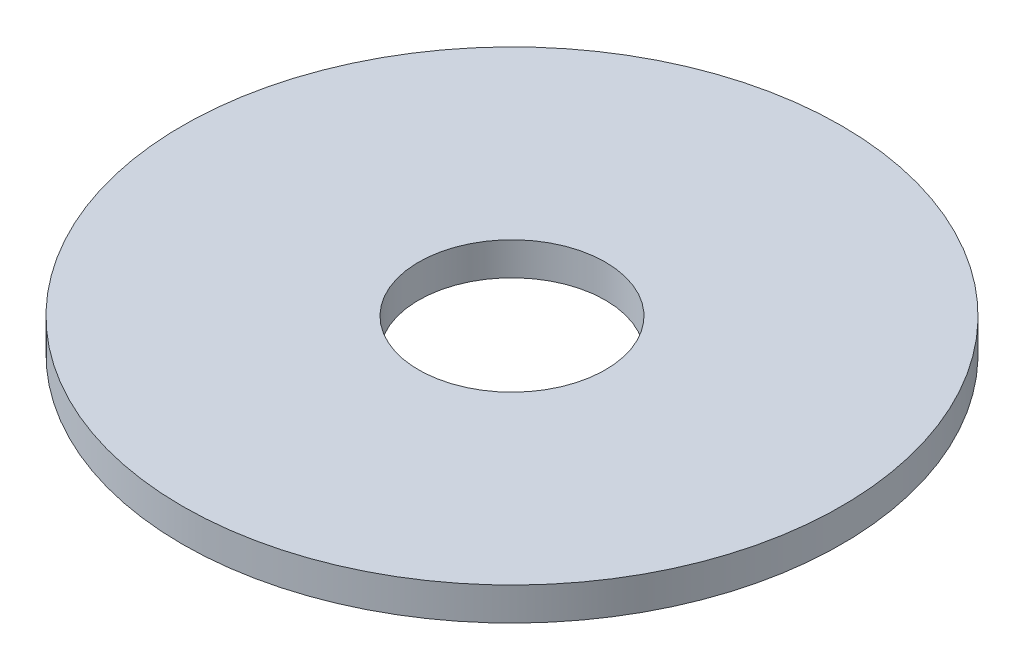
ISO-10303-21;
HEADER;
FILE_DESCRIPTION(('STEP AP214'),'2;1');
FILE_NAME('part.step','',(''),(''),'','','');
FILE_SCHEMA(('AUTOMOTIVE_DESIGN { 1 0 10303 214 1 1 1 1 }'));
ENDSEC;
DATA;
#1=APPLICATION_CONTEXT('core data for automotive mechanical design processes');
#2=APPLICATION_PROTOCOL_DEFINITION('international standard','automotive_design',2000,#1);
#3=PRODUCT_CONTEXT('',#1,'mechanical');
#4=PRODUCT('Part','Part','',(#3));
#5=PRODUCT_RELATED_PRODUCT_CATEGORY('part','',(#4));
#6=PRODUCT_DEFINITION_FORMATION('','',#4);
#7=PRODUCT_DEFINITION_CONTEXT('part definition',#1,'design');
#8=PRODUCT_DEFINITION('design','',#6,#7);
#9=PRODUCT_DEFINITION_SHAPE('','',#8);
#10=(LENGTH_UNIT() NAMED_UNIT(*) SI_UNIT(.MILLI.,.METRE.));
#11=(NAMED_UNIT(*) PLANE_ANGLE_UNIT() SI_UNIT($,.RADIAN.));
#12=(NAMED_UNIT(*) SI_UNIT($,.STERADIAN.) SOLID_ANGLE_UNIT());
#13=UNCERTAINTY_MEASURE_WITH_UNIT(LENGTH_MEASURE(1.E-05),#10,'distance_accuracy_value','');
#14=(GEOMETRIC_REPRESENTATION_CONTEXT(3) GLOBAL_UNCERTAINTY_ASSIGNED_CONTEXT((#13)) GLOBAL_UNIT_ASSIGNED_CONTEXT((#10,
#11,#12)) REPRESENTATION_CONTEXT('',''));
#15=CARTESIAN_POINT('',(0.,0.,0.));
#16=DIRECTION('',(0.,0.,1.));
#17=DIRECTION('',(1.,0.,0.));
#18=AXIS2_PLACEMENT_3D('',#15,#16,#17);
#19=CARTESIAN_POINT('',(0.,0.,0.));
#20=DIRECTION('',(0.,-1.,0.));
#21=DIRECTION('',(0.,0.,-1.));
#22=AXIS2_PLACEMENT_3D('',#19,#20,#21);
#23=CYLINDRICAL_SURFACE('',#22,4.25);
#24=CARTESIAN_POINT('',(0.,0.,0.));
#25=DIRECTION('',(0.,-1.,0.));
#26=DIRECTION('',(0.,0.,-1.));
#27=AXIS2_PLACEMENT_3D('',#24,#25,#26);
#28=CIRCLE('',#27,4.25);
#29=CARTESIAN_POINT('',(0.,0.,-4.25));
#30=VERTEX_POINT('',#29);
#31=EDGE_CURVE('E42',#30,#30,#28,.T.);
#32=ORIENTED_EDGE('',*,*,#31,.T.);
#33=EDGE_LOOP('',(#32));
#34=FACE_BOUND('',#33,.T.);
#35=CARTESIAN_POINT('',(0.,1.5,0.));
#36=DIRECTION('',(0.,-1.,0.));
#37=DIRECTION('',(0.,0.,-1.));
#38=AXIS2_PLACEMENT_3D('',#35,#36,#37);
#39=CIRCLE('',#38,4.25);
#40=CARTESIAN_POINT('',(0.,1.5,-4.25));
#41=VERTEX_POINT('',#40);
#42=EDGE_CURVE('E10',#41,#41,#39,.T.);
#43=ORIENTED_EDGE('',*,*,#42,.F.);
#44=EDGE_LOOP('',(#43));
#45=FACE_BOUND('',#44,.T.);
#46=ADVANCED_FACE('F28',(#34,#45),#23,.F.);
#47=CARTESIAN_POINT('',(4.25,1.5,0.));
#48=DIRECTION('',(0.,1.,0.));
#49=DIRECTION('',(0.,0.,1.));
#50=AXIS2_PLACEMENT_3D('',#47,#48,#49);
#51=PLANE('',#50);
#52=ORIENTED_EDGE('',*,*,#42,.T.);
#53=EDGE_LOOP('',(#52));
#54=FACE_BOUND('',#53,.T.);
#55=CARTESIAN_POINT('',(0.,1.5,0.));
#56=DIRECTION('',(0.,-1.,0.));
#57=DIRECTION('',(0.,0.,-1.));
#58=AXIS2_PLACEMENT_3D('',#55,#56,#57);
#59=CIRCLE('',#58,15.);
#60=CARTESIAN_POINT('',(0.,1.5,-15.));
#61=VERTEX_POINT('',#60);
#62=EDGE_CURVE('E34',#61,#61,#59,.T.);
#63=ORIENTED_EDGE('',*,*,#62,.F.);
#64=EDGE_LOOP('',(#63));
#65=FACE_BOUND('',#64,.T.);
#66=ADVANCED_FACE('F58',(#54,#65),#51,.T.);
#67=CARTESIAN_POINT('',(0.,0.,0.));
#68=DIRECTION('',(0.,-1.,0.));
#69=DIRECTION('',(0.,0.,-1.));
#70=AXIS2_PLACEMENT_3D('',#67,#68,#69);
#71=CYLINDRICAL_SURFACE('',#70,15.);
#72=ORIENTED_EDGE('',*,*,#62,.T.);
#73=EDGE_LOOP('',(#72));
#74=FACE_BOUND('',#73,.T.);
#75=CARTESIAN_POINT('',(0.,0.,0.));
#76=DIRECTION('',(0.,-1.,0.));
#77=DIRECTION('',(0.,0.,-1.));
#78=AXIS2_PLACEMENT_3D('',#75,#76,#77);
#79=CIRCLE('',#78,15.);
#80=CARTESIAN_POINT('',(0.,0.,-15.));
#81=VERTEX_POINT('',#80);
#82=EDGE_CURVE('E38',#81,#81,#79,.T.);
#83=ORIENTED_EDGE('',*,*,#82,.F.);
#84=EDGE_LOOP('',(#83));
#85=FACE_BOUND('',#84,.T.);
#86=ADVANCED_FACE('F52',(#74,#85),#71,.T.);
#87=CARTESIAN_POINT('',(4.25,0.,0.));
#88=DIRECTION('',(0.,-1.,0.));
#89=DIRECTION('',(0.,0.,-1.));
#90=AXIS2_PLACEMENT_3D('',#87,#88,#89);
#91=PLANE('',#90);
#92=ORIENTED_EDGE('',*,*,#82,.T.);
#93=EDGE_LOOP('',(#92));
#94=FACE_BOUND('',#93,.T.);
#95=ORIENTED_EDGE('',*,*,#31,.F.);
#96=EDGE_LOOP('',(#95));
#97=FACE_BOUND('',#96,.T.);
#98=ADVANCED_FACE('F50',(#94,#97),#91,.T.);
#99=CLOSED_SHELL('',(#46,#66,#86,#98));
#100=MANIFOLD_SOLID_BREP('B2',#99);
#101=ADVANCED_BREP_SHAPE_REPRESENTATION('',(#18,#100),#14);
#102=SHAPE_DEFINITION_REPRESENTATION(#9,#101);
ENDSEC;
END-ISO-10303-21;
